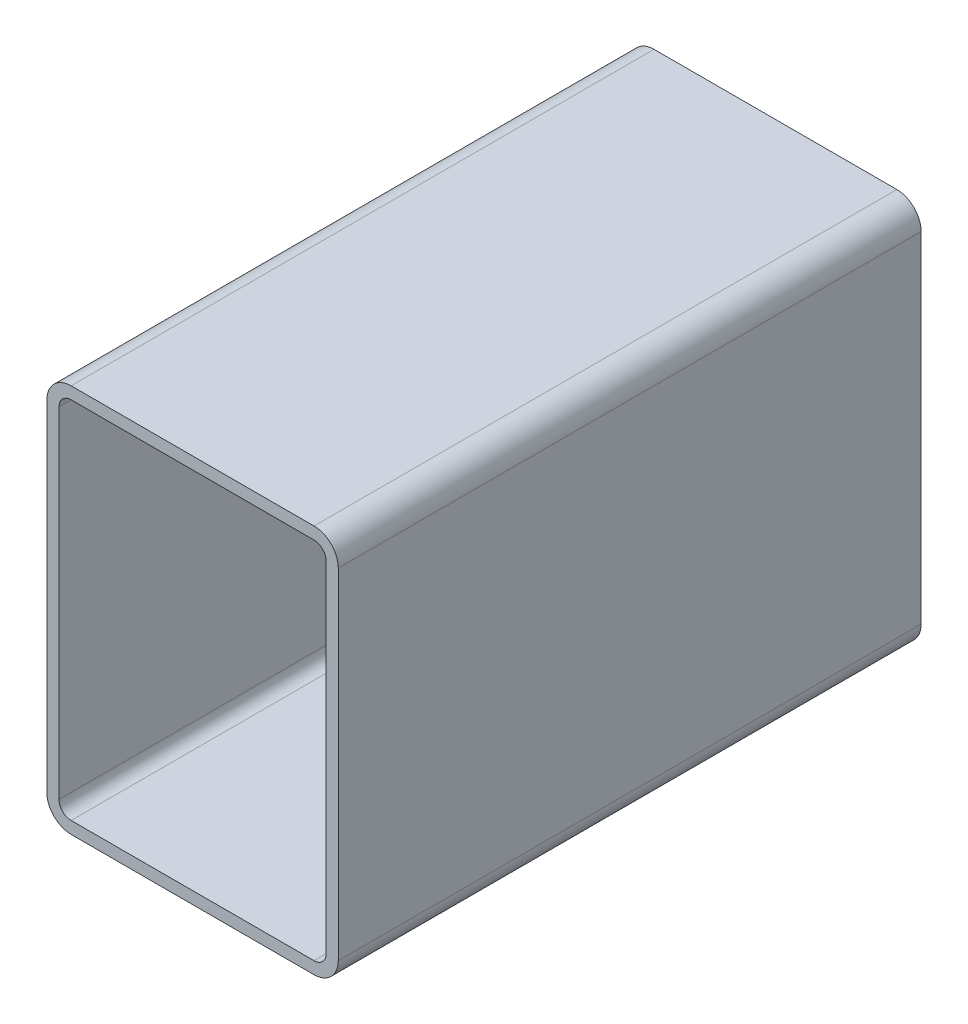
ISO-10303-21;
HEADER;
FILE_DESCRIPTION(('STEP AP214'),'2;1');
FILE_NAME('part.step','',(''),(''),'','','');
FILE_SCHEMA(('AUTOMOTIVE_DESIGN { 1 0 10303 214 1 1 1 1 }'));
ENDSEC;
DATA;
#1=APPLICATION_CONTEXT('core data for automotive mechanical design processes');
#2=APPLICATION_PROTOCOL_DEFINITION('international standard','automotive_design',2000,#1);
#3=PRODUCT_CONTEXT('',#1,'mechanical');
#4=PRODUCT('Part','Part','',(#3));
#5=PRODUCT_RELATED_PRODUCT_CATEGORY('part','',(#4));
#6=PRODUCT_DEFINITION_FORMATION('','',#4);
#7=PRODUCT_DEFINITION_CONTEXT('part definition',#1,'design');
#8=PRODUCT_DEFINITION('design','',#6,#7);
#9=PRODUCT_DEFINITION_SHAPE('','',#8);
#10=(LENGTH_UNIT() NAMED_UNIT(*) SI_UNIT(.MILLI.,.METRE.));
#11=(NAMED_UNIT(*) PLANE_ANGLE_UNIT() SI_UNIT($,.RADIAN.));
#12=(NAMED_UNIT(*) SI_UNIT($,.STERADIAN.) SOLID_ANGLE_UNIT());
#13=UNCERTAINTY_MEASURE_WITH_UNIT(LENGTH_MEASURE(1.E-05),#10,'distance_accuracy_value','');
#14=(GEOMETRIC_REPRESENTATION_CONTEXT(3) GLOBAL_UNCERTAINTY_ASSIGNED_CONTEXT((#13)) GLOBAL_UNIT_ASSIGNED_CONTEXT((#10,
#11,#12)) REPRESENTATION_CONTEXT('',''));
#15=CARTESIAN_POINT('',(0.,0.,0.));
#16=DIRECTION('',(0.,0.,1.));
#17=DIRECTION('',(1.,0.,0.));
#18=AXIS2_PLACEMENT_3D('',#15,#16,#17);
#19=CARTESIAN_POINT('',(12.7473013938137,192.466130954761,304.8));
#20=DIRECTION('',(0.,0.,1.));
#21=DIRECTION('',(1.,0.,0.));
#22=AXIS2_PLACEMENT_3D('',#19,#20,#21);
#23=PLANE('',#22);
#24=CARTESIAN_POINT('',(12.7473013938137,192.466130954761,304.8));
#25=DIRECTION('',(0.,0.,1.));
#26=DIRECTION('',(1.,0.,0.));
#27=AXIS2_PLACEMENT_3D('',#24,#25,#26);
#28=CIRCLE('',#27,12.7);
#29=CARTESIAN_POINT('',(12.7473013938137,205.166130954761,304.8));
#30=VERTEX_POINT('',#29);
#31=CARTESIAN_POINT('',(0.0473013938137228,192.466130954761,304.8));
#32=VERTEX_POINT('',#31);
#33=EDGE_CURVE('E211',#30,#32,#28,.T.);
#34=ORIENTED_EDGE('',*,*,#33,.T.);
#35=DIRECTION('',(0.,-1.,0.));
#36=VECTOR('',#35,1.);
#37=CARTESIAN_POINT('',(0.0473013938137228,14.6661309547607,304.8));
#38=LINE('',#37,#36);
#39=CARTESIAN_POINT('',(0.0473013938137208,14.6661309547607,304.8));
#40=VERTEX_POINT('',#39);
#41=EDGE_CURVE('E214',#32,#40,#38,.T.);
#42=ORIENTED_EDGE('',*,*,#41,.T.);
#43=CARTESIAN_POINT('',(12.7473013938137,14.6661309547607,304.8));
#44=DIRECTION('',(0.,0.,1.));
#45=DIRECTION('',(1.,0.,0.));
#46=AXIS2_PLACEMENT_3D('',#43,#44,#45);
#47=CIRCLE('',#46,12.7);
#48=CARTESIAN_POINT('',(12.7473013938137,1.96613095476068,304.8));
#49=VERTEX_POINT('',#48);
#50=EDGE_CURVE('E217',#40,#49,#47,.T.);
#51=ORIENTED_EDGE('',*,*,#50,.T.);
#52=DIRECTION('',(1.,0.,0.));
#53=VECTOR('',#52,1.);
#54=CARTESIAN_POINT('',(139.747301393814,1.96613095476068,304.8));
#55=LINE('',#54,#53);
#56=CARTESIAN_POINT('',(139.747301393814,1.96613095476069,304.8));
#57=VERTEX_POINT('',#56);
#58=EDGE_CURVE('E219',#49,#57,#55,.T.);
#59=ORIENTED_EDGE('',*,*,#58,.T.);
#60=CARTESIAN_POINT('',(139.747301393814,14.6661309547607,304.8));
#61=DIRECTION('',(0.,0.,1.));
#62=DIRECTION('',(1.,0.,0.));
#63=AXIS2_PLACEMENT_3D('',#60,#61,#62);
#64=CIRCLE('',#63,12.7);
#65=CARTESIAN_POINT('',(152.447301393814,14.6661309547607,304.8));
#66=VERTEX_POINT('',#65);
#67=EDGE_CURVE('E221',#57,#66,#64,.T.);
#68=ORIENTED_EDGE('',*,*,#67,.T.);
#69=DIRECTION('',(0.,1.,0.));
#70=VECTOR('',#69,1.);
#71=CARTESIAN_POINT('',(152.447301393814,192.466130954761,304.8));
#72=LINE('',#71,#70);
#73=CARTESIAN_POINT('',(152.447301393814,192.466130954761,304.8));
#74=VERTEX_POINT('',#73);
#75=EDGE_CURVE('E223',#66,#74,#72,.T.);
#76=ORIENTED_EDGE('',*,*,#75,.T.);
#77=CARTESIAN_POINT('',(139.747301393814,192.466130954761,304.8));
#78=DIRECTION('',(0.,0.,1.));
#79=DIRECTION('',(1.,0.,0.));
#80=AXIS2_PLACEMENT_3D('',#77,#78,#79);
#81=CIRCLE('',#80,12.7);
#82=CARTESIAN_POINT('',(139.747301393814,205.166130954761,304.8));
#83=VERTEX_POINT('',#82);
#84=EDGE_CURVE('E225',#74,#83,#81,.T.);
#85=ORIENTED_EDGE('',*,*,#84,.T.);
#86=DIRECTION('',(-1.,0.,0.));
#87=VECTOR('',#86,1.);
#88=CARTESIAN_POINT('',(12.7473013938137,205.166130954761,304.8));
#89=LINE('',#88,#87);
#90=EDGE_CURVE('E227',#83,#30,#89,.T.);
#91=ORIENTED_EDGE('',*,*,#90,.T.);
#92=EDGE_LOOP('',(#34,#42,#51,#59,#68,#76,#85,#91));
#93=FACE_BOUND('',#92,.T.);
#94=DIRECTION('',(0.,-1.,0.));
#95=VECTOR('',#94,1.);
#96=CARTESIAN_POINT('',(6.39730139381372,14.6661309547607,304.8));
#97=LINE('',#96,#95);
#98=CARTESIAN_POINT('',(6.39730139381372,192.466130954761,304.8));
#99=VERTEX_POINT('',#98);
#100=CARTESIAN_POINT('',(6.39730139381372,14.6661309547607,304.8));
#101=VERTEX_POINT('',#100);
#102=EDGE_CURVE('E154',#99,#101,#97,.T.);
#103=ORIENTED_EDGE('',*,*,#102,.F.);
#104=CARTESIAN_POINT('',(12.7473013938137,192.466130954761,304.8));
#105=DIRECTION('',(0.,0.,1.));
#106=DIRECTION('',(1.,0.,0.));
#107=AXIS2_PLACEMENT_3D('',#104,#105,#106);
#108=CIRCLE('',#107,6.35000000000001);
#109=CARTESIAN_POINT('',(12.7473013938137,198.816130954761,304.8));
#110=VERTEX_POINT('',#109);
#111=EDGE_CURVE('E146',#110,#99,#108,.T.);
#112=ORIENTED_EDGE('',*,*,#111,.F.);
#113=DIRECTION('',(-1.,0.,0.));
#114=VECTOR('',#113,1.);
#115=CARTESIAN_POINT('',(12.7473013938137,198.816130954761,304.8));
#116=LINE('',#115,#114);
#117=CARTESIAN_POINT('',(139.747301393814,198.816130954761,304.8));
#118=VERTEX_POINT('',#117);
#119=EDGE_CURVE('E179',#118,#110,#116,.T.);
#120=ORIENTED_EDGE('',*,*,#119,.F.);
#121=CARTESIAN_POINT('',(139.747301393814,192.466130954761,304.8));
#122=DIRECTION('',(0.,0.,1.));
#123=DIRECTION('',(1.,0.,0.));
#124=AXIS2_PLACEMENT_3D('',#121,#122,#123);
#125=CIRCLE('',#124,6.35000000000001);
#126=CARTESIAN_POINT('',(146.097301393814,192.466130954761,304.8));
#127=VERTEX_POINT('',#126);
#128=EDGE_CURVE('E177',#127,#118,#125,.T.);
#129=ORIENTED_EDGE('',*,*,#128,.F.);
#130=DIRECTION('',(0.,1.,0.));
#131=VECTOR('',#130,1.);
#132=CARTESIAN_POINT('',(146.097301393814,192.466130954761,304.8));
#133=LINE('',#132,#131);
#134=CARTESIAN_POINT('',(146.097301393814,14.6661309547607,304.8));
#135=VERTEX_POINT('',#134);
#136=EDGE_CURVE('E175',#135,#127,#133,.T.);
#137=ORIENTED_EDGE('',*,*,#136,.F.);
#138=CARTESIAN_POINT('',(139.747301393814,14.6661309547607,304.8));
#139=DIRECTION('',(0.,0.,1.));
#140=DIRECTION('',(1.,0.,0.));
#141=AXIS2_PLACEMENT_3D('',#138,#139,#140);
#142=CIRCLE('',#141,6.35);
#143=CARTESIAN_POINT('',(139.747301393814,8.31613095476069,304.8));
#144=VERTEX_POINT('',#143);
#145=EDGE_CURVE('E173',#144,#135,#142,.T.);
#146=ORIENTED_EDGE('',*,*,#145,.F.);
#147=DIRECTION('',(1.,0.,0.));
#148=VECTOR('',#147,1.);
#149=CARTESIAN_POINT('',(139.747301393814,8.31613095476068,304.8));
#150=LINE('',#149,#148);
#151=CARTESIAN_POINT('',(12.7473013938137,8.31613095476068,304.8));
#152=VERTEX_POINT('',#151);
#153=EDGE_CURVE('E169',#152,#144,#150,.T.);
#154=ORIENTED_EDGE('',*,*,#153,.F.);
#155=CARTESIAN_POINT('',(12.7473013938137,14.6661309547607,304.8));
#156=DIRECTION('',(0.,0.,1.));
#157=DIRECTION('',(1.,0.,0.));
#158=AXIS2_PLACEMENT_3D('',#155,#156,#157);
#159=CIRCLE('',#158,6.35);
#160=EDGE_CURVE('E167',#101,#152,#159,.T.);
#161=ORIENTED_EDGE('',*,*,#160,.F.);
#162=EDGE_LOOP('',(#103,#112,#120,#129,#137,#146,#154,#161));
#163=FACE_BOUND('',#162,.T.);
#164=ADVANCED_FACE('F33',(#93,#163),#23,.T.);
#165=CARTESIAN_POINT('',(12.7473013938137,192.466130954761,0.));
#166=DIRECTION('',(0.,0.,1.));
#167=DIRECTION('',(1.,0.,0.));
#168=AXIS2_PLACEMENT_3D('',#165,#166,#167);
#169=PLANE('',#168);
#170=CARTESIAN_POINT('',(12.7473013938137,192.466130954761,0.));
#171=DIRECTION('',(0.,0.,1.));
#172=DIRECTION('',(1.,0.,0.));
#173=AXIS2_PLACEMENT_3D('',#170,#171,#172);
#174=CIRCLE('',#173,12.7);
#175=CARTESIAN_POINT('',(12.7473013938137,205.166130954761,0.));
#176=VERTEX_POINT('',#175);
#177=CARTESIAN_POINT('',(0.0473013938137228,192.466130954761,0.));
#178=VERTEX_POINT('',#177);
#179=EDGE_CURVE('E162',#176,#178,#174,.T.);
#180=ORIENTED_EDGE('',*,*,#179,.F.);
#181=DIRECTION('',(-1.,0.,0.));
#182=VECTOR('',#181,1.);
#183=CARTESIAN_POINT('',(12.7473013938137,205.166130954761,0.));
#184=LINE('',#183,#182);
#185=CARTESIAN_POINT('',(139.747301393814,205.166130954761,0.));
#186=VERTEX_POINT('',#185);
#187=EDGE_CURVE('E215',#186,#176,#184,.T.);
#188=ORIENTED_EDGE('',*,*,#187,.F.);
#189=CARTESIAN_POINT('',(139.747301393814,192.466130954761,0.));
#190=DIRECTION('',(0.,0.,1.));
#191=DIRECTION('',(1.,0.,0.));
#192=AXIS2_PLACEMENT_3D('',#189,#190,#191);
#193=CIRCLE('',#192,12.7);
#194=CARTESIAN_POINT('',(152.447301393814,192.466130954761,0.));
#195=VERTEX_POINT('',#194);
#196=EDGE_CURVE('E242',#195,#186,#193,.T.);
#197=ORIENTED_EDGE('',*,*,#196,.F.);
#198=DIRECTION('',(0.,1.,0.));
#199=VECTOR('',#198,1.);
#200=CARTESIAN_POINT('',(152.447301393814,192.466130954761,0.));
#201=LINE('',#200,#199);
#202=CARTESIAN_POINT('',(152.447301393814,14.6661309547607,0.));
#203=VERTEX_POINT('',#202);
#204=EDGE_CURVE('E240',#203,#195,#201,.T.);
#205=ORIENTED_EDGE('',*,*,#204,.F.);
#206=CARTESIAN_POINT('',(139.747301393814,14.6661309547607,0.));
#207=DIRECTION('',(0.,0.,1.));
#208=DIRECTION('',(1.,0.,0.));
#209=AXIS2_PLACEMENT_3D('',#206,#207,#208);
#210=CIRCLE('',#209,12.7);
#211=CARTESIAN_POINT('',(139.747301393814,1.96613095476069,0.));
#212=VERTEX_POINT('',#211);
#213=EDGE_CURVE('E238',#212,#203,#210,.T.);
#214=ORIENTED_EDGE('',*,*,#213,.F.);
#215=DIRECTION('',(1.,0.,0.));
#216=VECTOR('',#215,1.);
#217=CARTESIAN_POINT('',(139.747301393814,1.96613095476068,0.));
#218=LINE('',#217,#216);
#219=CARTESIAN_POINT('',(12.7473013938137,1.96613095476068,0.));
#220=VERTEX_POINT('',#219);
#221=EDGE_CURVE('E236',#220,#212,#218,.T.);
#222=ORIENTED_EDGE('',*,*,#221,.F.);
#223=CARTESIAN_POINT('',(12.7473013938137,14.6661309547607,0.));
#224=DIRECTION('',(0.,0.,1.));
#225=DIRECTION('',(1.,0.,0.));
#226=AXIS2_PLACEMENT_3D('',#223,#224,#225);
#227=CIRCLE('',#226,12.7);
#228=CARTESIAN_POINT('',(0.0473013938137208,14.6661309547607,0.));
#229=VERTEX_POINT('',#228);
#230=EDGE_CURVE('E234',#229,#220,#227,.T.);
#231=ORIENTED_EDGE('',*,*,#230,.F.);
#232=DIRECTION('',(0.,-1.,0.));
#233=VECTOR('',#232,1.);
#234=CARTESIAN_POINT('',(0.0473013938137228,14.6661309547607,0.));
#235=LINE('',#234,#233);
#236=EDGE_CURVE('E232',#178,#229,#235,.T.);
#237=ORIENTED_EDGE('',*,*,#236,.F.);
#238=EDGE_LOOP('',(#180,#188,#197,#205,#214,#222,#231,#237));
#239=FACE_BOUND('',#238,.T.);
#240=CARTESIAN_POINT('',(12.7473013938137,192.466130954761,0.));
#241=DIRECTION('',(0.,0.,1.));
#242=DIRECTION('',(1.,0.,0.));
#243=AXIS2_PLACEMENT_3D('',#240,#241,#242);
#244=CIRCLE('',#243,6.35000000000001);
#245=CARTESIAN_POINT('',(12.7473013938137,198.816130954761,0.));
#246=VERTEX_POINT('',#245);
#247=CARTESIAN_POINT('',(6.39730139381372,192.466130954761,0.));
#248=VERTEX_POINT('',#247);
#249=EDGE_CURVE('E56',#246,#248,#244,.T.);
#250=ORIENTED_EDGE('',*,*,#249,.T.);
#251=DIRECTION('',(0.,-1.,0.));
#252=VECTOR('',#251,1.);
#253=CARTESIAN_POINT('',(6.39730139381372,14.6661309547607,0.));
#254=LINE('',#253,#252);
#255=CARTESIAN_POINT('',(6.39730139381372,14.6661309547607,0.));
#256=VERTEX_POINT('',#255);
#257=EDGE_CURVE('E161',#248,#256,#254,.T.);
#258=ORIENTED_EDGE('',*,*,#257,.T.);
#259=CARTESIAN_POINT('',(12.7473013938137,14.6661309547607,0.));
#260=DIRECTION('',(0.,0.,1.));
#261=DIRECTION('',(1.,0.,0.));
#262=AXIS2_PLACEMENT_3D('',#259,#260,#261);
#263=CIRCLE('',#262,6.35);
#264=CARTESIAN_POINT('',(12.7473013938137,8.31613095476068,0.));
#265=VERTEX_POINT('',#264);
#266=EDGE_CURVE('E183',#256,#265,#263,.T.);
#267=ORIENTED_EDGE('',*,*,#266,.T.);
#268=DIRECTION('',(1.,0.,0.));
#269=VECTOR('',#268,1.);
#270=CARTESIAN_POINT('',(139.747301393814,8.31613095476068,0.));
#271=LINE('',#270,#269);
#272=CARTESIAN_POINT('',(139.747301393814,8.31613095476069,0.));
#273=VERTEX_POINT('',#272);
#274=EDGE_CURVE('E186',#265,#273,#271,.T.);
#275=ORIENTED_EDGE('',*,*,#274,.T.);
#276=CARTESIAN_POINT('',(139.747301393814,14.6661309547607,0.));
#277=DIRECTION('',(0.,0.,1.));
#278=DIRECTION('',(1.,0.,0.));
#279=AXIS2_PLACEMENT_3D('',#276,#277,#278);
#280=CIRCLE('',#279,6.35);
#281=CARTESIAN_POINT('',(146.097301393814,14.6661309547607,0.));
#282=VERTEX_POINT('',#281);
#283=EDGE_CURVE('E189',#273,#282,#280,.T.);
#284=ORIENTED_EDGE('',*,*,#283,.T.);
#285=DIRECTION('',(0.,1.,0.));
#286=VECTOR('',#285,1.);
#287=CARTESIAN_POINT('',(146.097301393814,192.466130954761,0.));
#288=LINE('',#287,#286);
#289=CARTESIAN_POINT('',(146.097301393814,192.466130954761,0.));
#290=VERTEX_POINT('',#289);
#291=EDGE_CURVE('E192',#282,#290,#288,.T.);
#292=ORIENTED_EDGE('',*,*,#291,.T.);
#293=CARTESIAN_POINT('',(139.747301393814,192.466130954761,0.));
#294=DIRECTION('',(0.,0.,1.));
#295=DIRECTION('',(1.,0.,0.));
#296=AXIS2_PLACEMENT_3D('',#293,#294,#295);
#297=CIRCLE('',#296,6.35000000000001);
#298=CARTESIAN_POINT('',(139.747301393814,198.816130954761,0.));
#299=VERTEX_POINT('',#298);
#300=EDGE_CURVE('E195',#290,#299,#297,.T.);
#301=ORIENTED_EDGE('',*,*,#300,.T.);
#302=DIRECTION('',(-1.,0.,0.));
#303=VECTOR('',#302,1.);
#304=CARTESIAN_POINT('',(12.7473013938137,198.816130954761,0.));
#305=LINE('',#304,#303);
#306=EDGE_CURVE('E155',#299,#246,#305,.T.);
#307=ORIENTED_EDGE('',*,*,#306,.T.);
#308=EDGE_LOOP('',(#250,#258,#267,#275,#284,#292,#301,#307));
#309=FACE_BOUND('',#308,.T.);
#310=ADVANCED_FACE('F272',(#239,#309),#169,.F.);
#311=CARTESIAN_POINT('',(12.7473013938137,192.466130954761,304.8));
#312=DIRECTION('',(0.,0.,-1.));
#313=DIRECTION('',(-1.,0.,0.));
#314=AXIS2_PLACEMENT_3D('',#311,#312,#313);
#315=CYLINDRICAL_SURFACE('',#314,12.7);
#316=ORIENTED_EDGE('',*,*,#179,.T.);
#317=DIRECTION('',(0.,0.,-1.));
#318=VECTOR('',#317,1.);
#319=CARTESIAN_POINT('',(0.0473013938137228,192.466130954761,304.8));
#320=LINE('',#319,#318);
#321=EDGE_CURVE('E11',#32,#178,#320,.T.);
#322=ORIENTED_EDGE('',*,*,#321,.F.);
#323=ORIENTED_EDGE('',*,*,#33,.F.);
#324=DIRECTION('',(0.,0.,-1.));
#325=VECTOR('',#324,1.);
#326=CARTESIAN_POINT('',(12.7473013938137,205.166130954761,304.8));
#327=LINE('',#326,#325);
#328=EDGE_CURVE('E229',#30,#176,#327,.T.);
#329=ORIENTED_EDGE('',*,*,#328,.T.);
#330=EDGE_LOOP('',(#316,#322,#323,#329));
#331=FACE_BOUND('',#330,.T.);
#332=ADVANCED_FACE('F35',(#331),#315,.T.);
#333=CARTESIAN_POINT('',(0.0473013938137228,14.6661309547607,304.8));
#334=DIRECTION('',(1.,0.,0.));
#335=DIRECTION('',(0.,0.,-1.));
#336=AXIS2_PLACEMENT_3D('',#333,#334,#335);
#337=PLANE('',#336);
#338=ORIENTED_EDGE('',*,*,#236,.T.);
#339=DIRECTION('',(0.,0.,-1.));
#340=VECTOR('',#339,1.);
#341=CARTESIAN_POINT('',(0.0473013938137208,14.6661309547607,304.8));
#342=LINE('',#341,#340);
#343=EDGE_CURVE('E41',#40,#229,#342,.T.);
#344=ORIENTED_EDGE('',*,*,#343,.F.);
#345=ORIENTED_EDGE('',*,*,#41,.F.);
#346=ORIENTED_EDGE('',*,*,#321,.T.);
#347=EDGE_LOOP('',(#338,#344,#345,#346));
#348=FACE_BOUND('',#347,.T.);
#349=ADVANCED_FACE('F289',(#348),#337,.F.);
#350=CARTESIAN_POINT('',(12.7473013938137,14.6661309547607,304.8));
#351=DIRECTION('',(0.,0.,-1.));
#352=DIRECTION('',(-1.,0.,0.));
#353=AXIS2_PLACEMENT_3D('',#350,#351,#352);
#354=CYLINDRICAL_SURFACE('',#353,12.7);
#355=ORIENTED_EDGE('',*,*,#230,.T.);
#356=DIRECTION('',(0.,0.,-1.));
#357=VECTOR('',#356,1.);
#358=CARTESIAN_POINT('',(12.7473013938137,1.96613095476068,304.8));
#359=LINE('',#358,#357);
#360=EDGE_CURVE('E259',#49,#220,#359,.T.);
#361=ORIENTED_EDGE('',*,*,#360,.F.);
#362=ORIENTED_EDGE('',*,*,#50,.F.);
#363=ORIENTED_EDGE('',*,*,#343,.T.);
#364=EDGE_LOOP('',(#355,#361,#362,#363));
#365=FACE_BOUND('',#364,.T.);
#366=ADVANCED_FACE('F266',(#365),#354,.T.);
#367=CARTESIAN_POINT('',(139.747301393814,1.96613095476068,304.8));
#368=DIRECTION('',(0.,1.,0.));
#369=DIRECTION('',(0.,0.,1.));
#370=AXIS2_PLACEMENT_3D('',#367,#368,#369);
#371=PLANE('',#370);
#372=ORIENTED_EDGE('',*,*,#221,.T.);
#373=DIRECTION('',(0.,0.,-1.));
#374=VECTOR('',#373,1.);
#375=CARTESIAN_POINT('',(139.747301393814,1.96613095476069,304.8));
#376=LINE('',#375,#374);
#377=EDGE_CURVE('E256',#57,#212,#376,.T.);
#378=ORIENTED_EDGE('',*,*,#377,.F.);
#379=ORIENTED_EDGE('',*,*,#58,.F.);
#380=ORIENTED_EDGE('',*,*,#360,.T.);
#381=EDGE_LOOP('',(#372,#378,#379,#380));
#382=FACE_BOUND('',#381,.T.);
#383=ADVANCED_FACE('F278',(#382),#371,.F.);
#384=CARTESIAN_POINT('',(139.747301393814,14.6661309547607,304.8));
#385=DIRECTION('',(0.,0.,-1.));
#386=DIRECTION('',(-1.,0.,0.));
#387=AXIS2_PLACEMENT_3D('',#384,#385,#386);
#388=CYLINDRICAL_SURFACE('',#387,12.7);
#389=ORIENTED_EDGE('',*,*,#213,.T.);
#390=DIRECTION('',(0.,0.,-1.));
#391=VECTOR('',#390,1.);
#392=CARTESIAN_POINT('',(152.447301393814,14.6661309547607,304.8));
#393=LINE('',#392,#391);
#394=EDGE_CURVE('E253',#66,#203,#393,.T.);
#395=ORIENTED_EDGE('',*,*,#394,.F.);
#396=ORIENTED_EDGE('',*,*,#67,.F.);
#397=ORIENTED_EDGE('',*,*,#377,.T.);
#398=EDGE_LOOP('',(#389,#395,#396,#397));
#399=FACE_BOUND('',#398,.T.);
#400=ADVANCED_FACE('F282',(#399),#388,.T.);
#401=CARTESIAN_POINT('',(152.447301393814,192.466130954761,304.8));
#402=DIRECTION('',(-1.,0.,0.));
#403=DIRECTION('',(0.,0.,1.));
#404=AXIS2_PLACEMENT_3D('',#401,#402,#403);
#405=PLANE('',#404);
#406=ORIENTED_EDGE('',*,*,#204,.T.);
#407=DIRECTION('',(0.,0.,-1.));
#408=VECTOR('',#407,1.);
#409=CARTESIAN_POINT('',(152.447301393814,192.466130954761,304.8));
#410=LINE('',#409,#408);
#411=EDGE_CURVE('E250',#74,#195,#410,.T.);
#412=ORIENTED_EDGE('',*,*,#411,.F.);
#413=ORIENTED_EDGE('',*,*,#75,.F.);
#414=ORIENTED_EDGE('',*,*,#394,.T.);
#415=EDGE_LOOP('',(#406,#412,#413,#414));
#416=FACE_BOUND('',#415,.T.);
#417=ADVANCED_FACE('F302',(#416),#405,.F.);
#418=CARTESIAN_POINT('',(139.747301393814,192.466130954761,304.8));
#419=DIRECTION('',(0.,0.,-1.));
#420=DIRECTION('',(-1.,0.,0.));
#421=AXIS2_PLACEMENT_3D('',#418,#419,#420);
#422=CYLINDRICAL_SURFACE('',#421,12.7);
#423=ORIENTED_EDGE('',*,*,#196,.T.);
#424=DIRECTION('',(0.,0.,-1.));
#425=VECTOR('',#424,1.);
#426=CARTESIAN_POINT('',(139.747301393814,205.166130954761,304.8));
#427=LINE('',#426,#425);
#428=EDGE_CURVE('E247',#83,#186,#427,.T.);
#429=ORIENTED_EDGE('',*,*,#428,.F.);
#430=ORIENTED_EDGE('',*,*,#84,.F.);
#431=ORIENTED_EDGE('',*,*,#411,.T.);
#432=EDGE_LOOP('',(#423,#429,#430,#431));
#433=FACE_BOUND('',#432,.T.);
#434=ADVANCED_FACE('F300',(#433),#422,.T.);
#435=CARTESIAN_POINT('',(12.7473013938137,205.166130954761,304.8));
#436=DIRECTION('',(0.,-1.,0.));
#437=DIRECTION('',(0.,0.,-1.));
#438=AXIS2_PLACEMENT_3D('',#435,#436,#437);
#439=PLANE('',#438);
#440=ORIENTED_EDGE('',*,*,#187,.T.);
#441=ORIENTED_EDGE('',*,*,#328,.F.);
#442=ORIENTED_EDGE('',*,*,#90,.F.);
#443=ORIENTED_EDGE('',*,*,#428,.T.);
#444=EDGE_LOOP('',(#440,#441,#442,#443));
#445=FACE_BOUND('',#444,.T.);
#446=ADVANCED_FACE('F295',(#445),#439,.F.);
#447=CARTESIAN_POINT('',(12.7473013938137,192.466130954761,304.8));
#448=DIRECTION('',(0.,0.,-1.));
#449=DIRECTION('',(-1.,0.,0.));
#450=AXIS2_PLACEMENT_3D('',#447,#448,#449);
#451=CYLINDRICAL_SURFACE('',#450,6.35000000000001);
#452=ORIENTED_EDGE('',*,*,#249,.F.);
#453=DIRECTION('',(0.,0.,-1.));
#454=VECTOR('',#453,1.);
#455=CARTESIAN_POINT('',(12.7473013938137,198.816130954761,304.8));
#456=LINE('',#455,#454);
#457=EDGE_CURVE('E150',#110,#246,#456,.T.);
#458=ORIENTED_EDGE('',*,*,#457,.F.);
#459=ORIENTED_EDGE('',*,*,#111,.T.);
#460=DIRECTION('',(0.,0.,-1.));
#461=VECTOR('',#460,1.);
#462=CARTESIAN_POINT('',(6.39730139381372,192.466130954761,304.8));
#463=LINE('',#462,#461);
#464=EDGE_CURVE('E149',#99,#248,#463,.T.);
#465=ORIENTED_EDGE('',*,*,#464,.T.);
#466=EDGE_LOOP('',(#452,#458,#459,#465));
#467=FACE_BOUND('',#466,.T.);
#468=ADVANCED_FACE('F148',(#467),#451,.F.);
#469=CARTESIAN_POINT('',(6.39730139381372,14.6661309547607,304.8));
#470=DIRECTION('',(1.,0.,0.));
#471=DIRECTION('',(0.,0.,-1.));
#472=AXIS2_PLACEMENT_3D('',#469,#470,#471);
#473=PLANE('',#472);
#474=ORIENTED_EDGE('',*,*,#257,.F.);
#475=ORIENTED_EDGE('',*,*,#464,.F.);
#476=ORIENTED_EDGE('',*,*,#102,.T.);
#477=DIRECTION('',(0.,0.,-1.));
#478=VECTOR('',#477,1.);
#479=CARTESIAN_POINT('',(6.39730139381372,14.6661309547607,304.8));
#480=LINE('',#479,#478);
#481=EDGE_CURVE('E163',#101,#256,#480,.T.);
#482=ORIENTED_EDGE('',*,*,#481,.T.);
#483=EDGE_LOOP('',(#474,#475,#476,#482));
#484=FACE_BOUND('',#483,.T.);
#485=ADVANCED_FACE('F158',(#484),#473,.T.);
#486=CARTESIAN_POINT('',(12.7473013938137,14.6661309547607,304.8));
#487=DIRECTION('',(0.,0.,-1.));
#488=DIRECTION('',(-1.,0.,0.));
#489=AXIS2_PLACEMENT_3D('',#486,#487,#488);
#490=CYLINDRICAL_SURFACE('',#489,6.35);
#491=ORIENTED_EDGE('',*,*,#266,.F.);
#492=ORIENTED_EDGE('',*,*,#481,.F.);
#493=ORIENTED_EDGE('',*,*,#160,.T.);
#494=DIRECTION('',(0.,0.,-1.));
#495=VECTOR('',#494,1.);
#496=CARTESIAN_POINT('',(12.7473013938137,8.31613095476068,304.8));
#497=LINE('',#496,#495);
#498=EDGE_CURVE('E208',#152,#265,#497,.T.);
#499=ORIENTED_EDGE('',*,*,#498,.T.);
#500=EDGE_LOOP('',(#491,#492,#493,#499));
#501=FACE_BOUND('',#500,.T.);
#502=ADVANCED_FACE('F327',(#501),#490,.F.);
#503=CARTESIAN_POINT('',(139.747301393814,8.31613095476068,304.8));
#504=DIRECTION('',(0.,1.,0.));
#505=DIRECTION('',(0.,0.,1.));
#506=AXIS2_PLACEMENT_3D('',#503,#504,#505);
#507=PLANE('',#506);
#508=ORIENTED_EDGE('',*,*,#274,.F.);
#509=ORIENTED_EDGE('',*,*,#498,.F.);
#510=ORIENTED_EDGE('',*,*,#153,.T.);
#511=DIRECTION('',(0.,0.,-1.));
#512=VECTOR('',#511,1.);
#513=CARTESIAN_POINT('',(139.747301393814,8.31613095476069,304.8));
#514=LINE('',#513,#512);
#515=EDGE_CURVE('E206',#144,#273,#514,.T.);
#516=ORIENTED_EDGE('',*,*,#515,.T.);
#517=EDGE_LOOP('',(#508,#509,#510,#516));
#518=FACE_BOUND('',#517,.T.);
#519=ADVANCED_FACE('F331',(#518),#507,.T.);
#520=CARTESIAN_POINT('',(139.747301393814,14.6661309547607,304.8));
#521=DIRECTION('',(0.,0.,-1.));
#522=DIRECTION('',(-1.,0.,0.));
#523=AXIS2_PLACEMENT_3D('',#520,#521,#522);
#524=CYLINDRICAL_SURFACE('',#523,6.35);
#525=ORIENTED_EDGE('',*,*,#283,.F.);
#526=ORIENTED_EDGE('',*,*,#515,.F.);
#527=ORIENTED_EDGE('',*,*,#145,.T.);
#528=DIRECTION('',(0.,0.,-1.));
#529=VECTOR('',#528,1.);
#530=CARTESIAN_POINT('',(146.097301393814,14.6661309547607,304.8));
#531=LINE('',#530,#529);
#532=EDGE_CURVE('E204',#135,#282,#531,.T.);
#533=ORIENTED_EDGE('',*,*,#532,.T.);
#534=EDGE_LOOP('',(#525,#526,#527,#533));
#535=FACE_BOUND('',#534,.T.);
#536=ADVANCED_FACE('F337',(#535),#524,.F.);
#537=CARTESIAN_POINT('',(146.097301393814,192.466130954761,304.8));
#538=DIRECTION('',(-1.,0.,0.));
#539=DIRECTION('',(0.,0.,1.));
#540=AXIS2_PLACEMENT_3D('',#537,#538,#539);
#541=PLANE('',#540);
#542=ORIENTED_EDGE('',*,*,#291,.F.);
#543=ORIENTED_EDGE('',*,*,#532,.F.);
#544=ORIENTED_EDGE('',*,*,#136,.T.);
#545=DIRECTION('',(0.,0.,-1.));
#546=VECTOR('',#545,1.);
#547=CARTESIAN_POINT('',(146.097301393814,192.466130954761,304.8));
#548=LINE('',#547,#546);
#549=EDGE_CURVE('E202',#127,#290,#548,.T.);
#550=ORIENTED_EDGE('',*,*,#549,.T.);
#551=EDGE_LOOP('',(#542,#543,#544,#550));
#552=FACE_BOUND('',#551,.T.);
#553=ADVANCED_FACE('F341',(#552),#541,.T.);
#554=CARTESIAN_POINT('',(139.747301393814,192.466130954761,304.8));
#555=DIRECTION('',(0.,0.,-1.));
#556=DIRECTION('',(-1.,0.,0.));
#557=AXIS2_PLACEMENT_3D('',#554,#555,#556);
#558=CYLINDRICAL_SURFACE('',#557,6.35000000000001);
#559=ORIENTED_EDGE('',*,*,#300,.F.);
#560=ORIENTED_EDGE('',*,*,#549,.F.);
#561=ORIENTED_EDGE('',*,*,#128,.T.);
#562=DIRECTION('',(0.,0.,-1.));
#563=VECTOR('',#562,1.);
#564=CARTESIAN_POINT('',(139.747301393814,198.816130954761,304.8));
#565=LINE('',#564,#563);
#566=EDGE_CURVE('E48',#118,#299,#565,.T.);
#567=ORIENTED_EDGE('',*,*,#566,.T.);
#568=EDGE_LOOP('',(#559,#560,#561,#567));
#569=FACE_BOUND('',#568,.T.);
#570=ADVANCED_FACE('F345',(#569),#558,.F.);
#571=CARTESIAN_POINT('',(12.7473013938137,198.816130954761,304.8));
#572=DIRECTION('',(0.,-1.,0.));
#573=DIRECTION('',(0.,0.,-1.));
#574=AXIS2_PLACEMENT_3D('',#571,#572,#573);
#575=PLANE('',#574);
#576=ORIENTED_EDGE('',*,*,#306,.F.);
#577=ORIENTED_EDGE('',*,*,#566,.F.);
#578=ORIENTED_EDGE('',*,*,#119,.T.);
#579=ORIENTED_EDGE('',*,*,#457,.T.);
#580=EDGE_LOOP('',(#576,#577,#578,#579));
#581=FACE_BOUND('',#580,.T.);
#582=ADVANCED_FACE('F349',(#581),#575,.T.);
#583=CLOSED_SHELL('',(#164,#310,#332,#349,#366,#383,#400,#417,#434,#446,#468,#485,#502,#519,
#536,#553,#570,#582));
#584=MANIFOLD_SOLID_BREP('B2',#583);
#585=ADVANCED_BREP_SHAPE_REPRESENTATION('',(#18,#584),#14);
#586=SHAPE_DEFINITION_REPRESENTATION(#9,#585);
ENDSEC;
END-ISO-10303-21;
